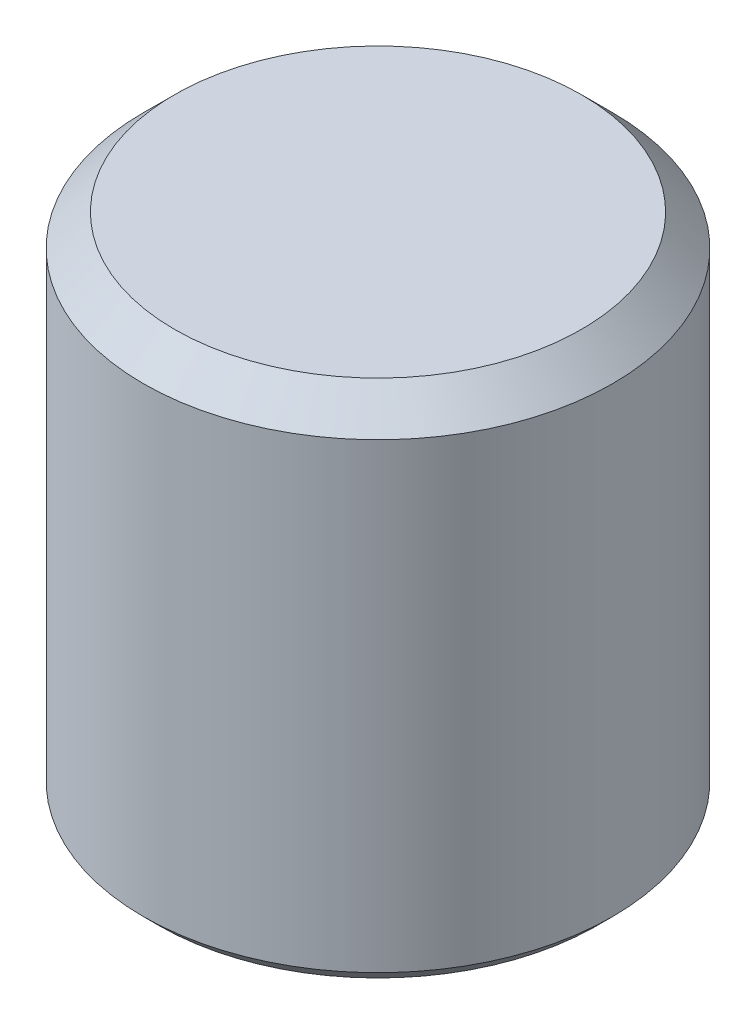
from build123d import *

# Parameters (mm, degrees)
SKETCH1_R           = 6
BOSS_EXTRUDE1_DEPTH = 13
SKETCH2_R           = 5
CUT_EXTRUDE1_DEPTH  = 10
CHAMFER1_SIZE       = 0.8
CHAMFER2_SIZE       = 0.4


with BuildPart() as part:
    # Sketch1 → Boss-Extrude1 (new body)
    with BuildSketch(Plane(origin=(0, 0, 0), x_dir=(1, 0, 0), z_dir=(0, 1, 0))):
        with Locations(Location((0, 0, 0), (0, 0, 90))):
            Circle(SKETCH1_R)
    extrude(amount=BOSS_EXTRUDE1_DEPTH)

    # Sketch2 → Cut-Extrude1 (cut)
    with BuildSketch(Plane.XZ):
        with Locations(Location((0, 0, 0), (0, 0, 270))):
            Circle(SKETCH2_R)
    extrude(amount=-CUT_EXTRUDE1_DEPTH, mode=Mode.SUBTRACT)

    # Chamfer1
    chamfer1_edges = [part.edges().sort_by_distance(p)[0] for p in [
        (0, 13, 6),
    ]]
    chamfer(chamfer1_edges, length=CHAMFER1_SIZE)

    # Chamfer2
    chamfer2_edges = [part.edges().sort_by_distance(p)[0] for p in [
        (0, 0, 6),
        (0, 0, 5),
    ]]
    chamfer(chamfer2_edges, length=CHAMFER2_SIZE)


solid = part.part
